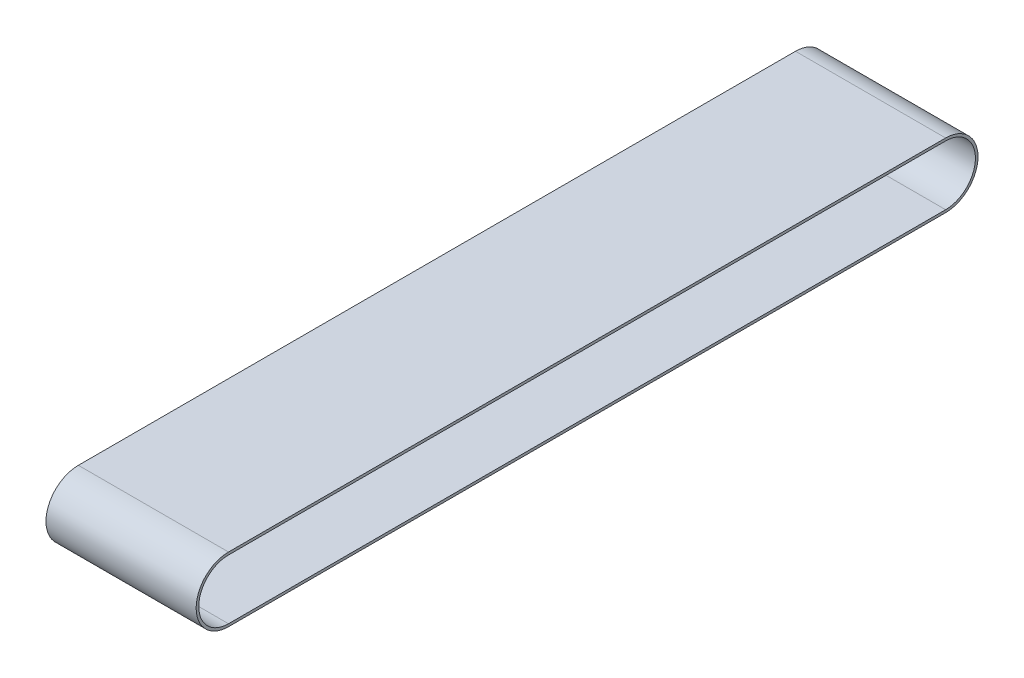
from build123d import *

# Parameters (mm, degrees)
LINEAR_AUSTRAGEN_D_NN1_DEPTH = 290


with BuildPart() as part:
    # Skizze1 → Linear-Austragen-D_nn1 (new body)
    with BuildSketch(Plane(origin=(3169.939297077, 0, 0), x_dir=(0, 0, -1), z_dir=(1, 0, 0))):
        with BuildLine():
            Line((1385, 62.5), (0, 62.5))
            ThreePointArc((0, 62.5), (-62.5, 0), (0, -62.5))
            Line((0, -62.5), (1385, -62.5))
            ThreePointArc((1385, -62.5), (1447.5, 0), (1385, 62.5))
        make_face()
        with BuildLine():
            Line((1385, 57.5), (0, 57.5))
            ThreePointArc((0, 57.5), (-57.5, 0), (0, -57.5))
            Line((0, -57.5), (1385, -57.5))
            ThreePointArc((1385, -57.5), (1442.5, 0), (1385, 57.5))
        make_face(mode=Mode.SUBTRACT)
    extrude(amount=-LINEAR_AUSTRAGEN_D_NN1_DEPTH)


solid = part.part
